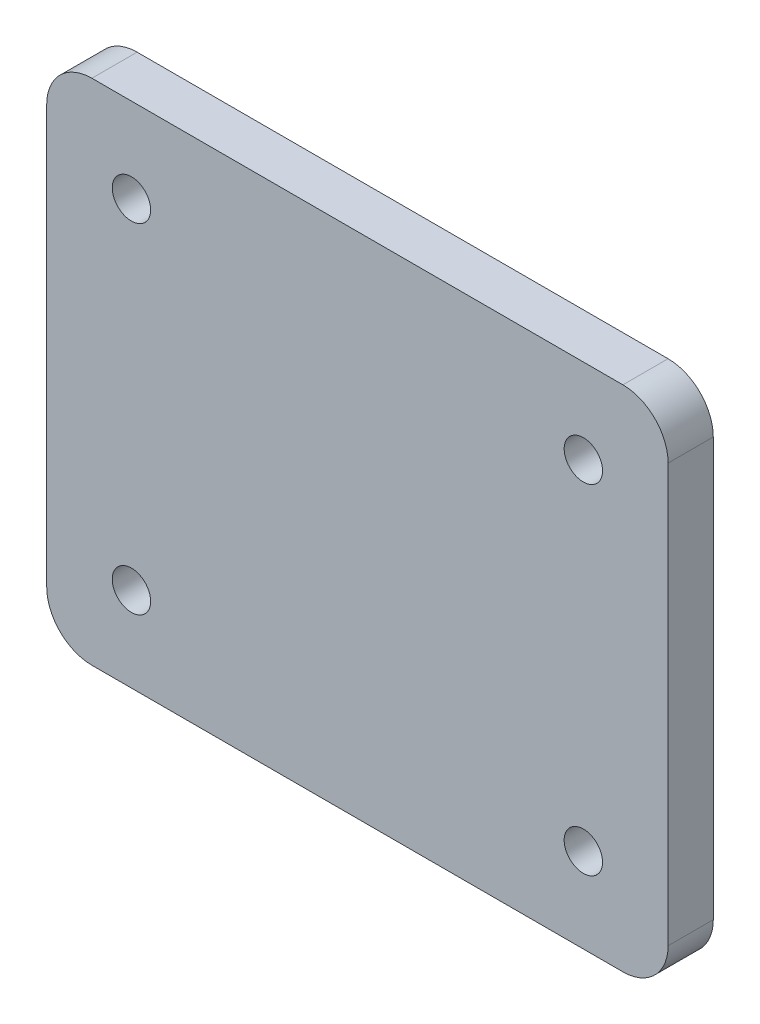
from build123d import *

# Parameters (mm, degrees)
SKIZZE1_R               = 2.5
LINEAR_AUSTRAGEN1_DEPTH = 8
M8_GEWINDEBOHRUNG1_D    = 6.8


with BuildPart() as part:
    # Skizze1 → Linear austragen1 (new body)
    with BuildSketch(Plane.XY):
        with BuildLine():
            Line((110, 8), (110, 82))
            ThreePointArc((110, 82), (107.656854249, 87.656854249), (102, 90))
            Line((102, 90), (8, 90))
            ThreePointArc((8, 90), (2.343145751, 87.656854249), (0, 82))
            Line((0, 82), (0, 8))
            ThreePointArc((0, 8), (2.343145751, 2.343145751), (8, 0))
            Line((8, 0), (102, 0))
            ThreePointArc((102, 0), (107.656854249, 2.343145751), (110, 8))
        make_face()
        with Locations((15, 15)):
            Circle(SKIZZE1_R, mode=Mode.SUBTRACT)
        with Locations((15, 75)):
            Circle(SKIZZE1_R, mode=Mode.SUBTRACT)
        with Locations((95, 75)):
            Circle(SKIZZE1_R, mode=Mode.SUBTRACT)
        with Locations((95, 15)):
            Circle(SKIZZE1_R, mode=Mode.SUBTRACT)
    extrude(amount=-LINEAR_AUSTRAGEN1_DEPTH)

    # M8 Gewindebohrung1 (through all)
    with Locations(Plane(origin=(15, 75, 0), x_dir=(1, 0, 0), z_dir=(0, 0, 1))):
        with Locations((0, 0), (0, -60), (80, -60), (80, 0)):
            Hole(M8_GEWINDEBOHRUNG1_D / 2)


solid = part.part
